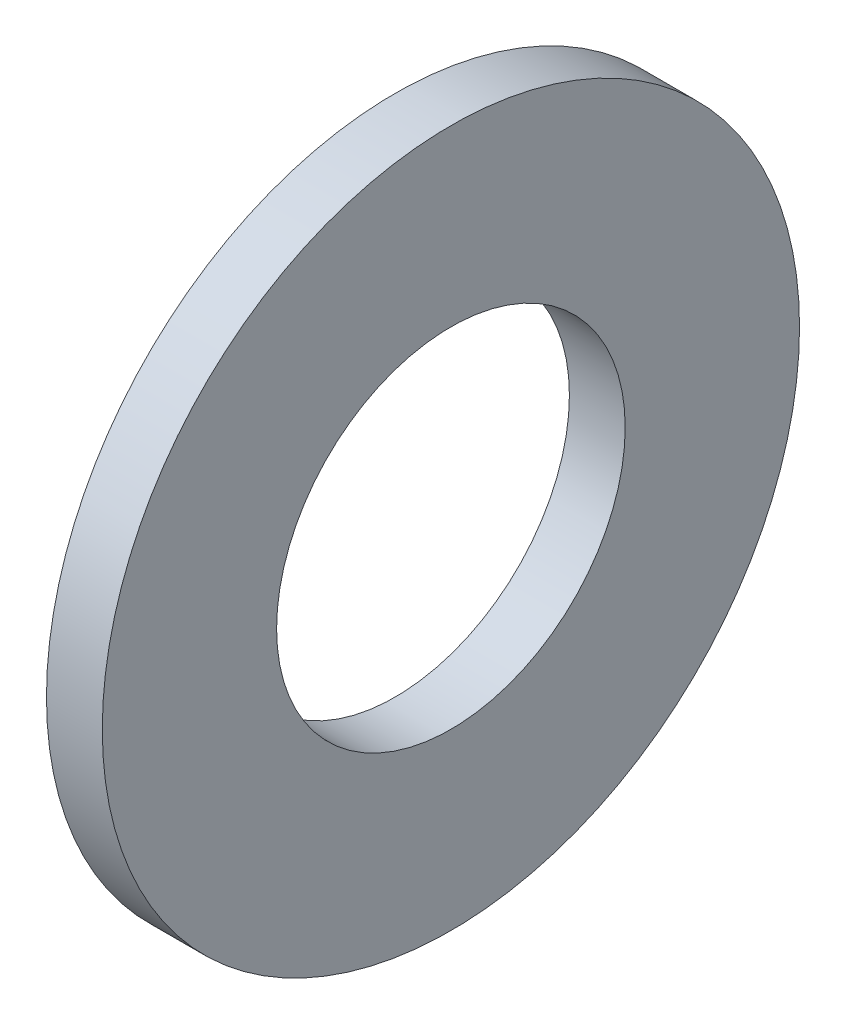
ISO-10303-21;
HEADER;
FILE_DESCRIPTION(('STEP AP214'),'2;1');
FILE_NAME('part.step','',(''),(''),'','','');
FILE_SCHEMA(('AUTOMOTIVE_DESIGN { 1 0 10303 214 1 1 1 1 }'));
ENDSEC;
DATA;
#1=APPLICATION_CONTEXT('core data for automotive mechanical design processes');
#2=APPLICATION_PROTOCOL_DEFINITION('international standard','automotive_design',2000,#1);
#3=PRODUCT_CONTEXT('',#1,'mechanical');
#4=PRODUCT('Part','Part','',(#3));
#5=PRODUCT_RELATED_PRODUCT_CATEGORY('part','',(#4));
#6=PRODUCT_DEFINITION_FORMATION('','',#4);
#7=PRODUCT_DEFINITION_CONTEXT('part definition',#1,'design');
#8=PRODUCT_DEFINITION('design','',#6,#7);
#9=PRODUCT_DEFINITION_SHAPE('','',#8);
#10=(LENGTH_UNIT() NAMED_UNIT(*) SI_UNIT(.MILLI.,.METRE.));
#11=(NAMED_UNIT(*) PLANE_ANGLE_UNIT() SI_UNIT($,.RADIAN.));
#12=(NAMED_UNIT(*) SI_UNIT($,.STERADIAN.) SOLID_ANGLE_UNIT());
#13=UNCERTAINTY_MEASURE_WITH_UNIT(LENGTH_MEASURE(1.E-05),#10,'distance_accuracy_value','');
#14=(GEOMETRIC_REPRESENTATION_CONTEXT(3) GLOBAL_UNCERTAINTY_ASSIGNED_CONTEXT((#13)) GLOBAL_UNIT_ASSIGNED_CONTEXT((#10,
#11,#12)) REPRESENTATION_CONTEXT('',''));
#15=CARTESIAN_POINT('',(0.,0.,0.));
#16=DIRECTION('',(0.,0.,1.));
#17=DIRECTION('',(1.,0.,0.));
#18=AXIS2_PLACEMENT_3D('',#15,#16,#17);
#19=CARTESIAN_POINT('',(-34.9249999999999,0.,0.));
#20=DIRECTION('',(-1.,0.,0.));
#21=DIRECTION('',(0.,0.,1.));
#22=AXIS2_PLACEMENT_3D('',#19,#20,#21);
#23=CYLINDRICAL_SURFACE('',#22,5.1562);
#24=CARTESIAN_POINT('',(0.,0.,0.));
#25=DIRECTION('',(-1.,0.,0.));
#26=DIRECTION('',(0.,0.,1.));
#27=AXIS2_PLACEMENT_3D('',#24,#25,#26);
#28=CIRCLE('',#27,5.1562);
#29=CARTESIAN_POINT('',(0.,0.,5.1562));
#30=VERTEX_POINT('',#29);
#31=EDGE_CURVE('E10',#30,#30,#28,.T.);
#32=ORIENTED_EDGE('',*,*,#31,.F.);
#33=EDGE_LOOP('',(#32));
#34=FACE_BOUND('',#33,.T.);
#35=CARTESIAN_POINT('',(-1.651,0.,0.));
#36=DIRECTION('',(-1.,0.,0.));
#37=DIRECTION('',(0.,0.,1.));
#38=AXIS2_PLACEMENT_3D('',#35,#36,#37);
#39=CIRCLE('',#38,5.1562);
#40=CARTESIAN_POINT('',(-1.651,0.,5.1562));
#41=VERTEX_POINT('',#40);
#42=EDGE_CURVE('E44',#41,#41,#39,.T.);
#43=ORIENTED_EDGE('',*,*,#42,.T.);
#44=EDGE_LOOP('',(#43));
#45=FACE_BOUND('',#44,.T.);
#46=ADVANCED_FACE('F30',(#34,#45),#23,.F.);
#47=CARTESIAN_POINT('',(0.,5.1562,0.));
#48=DIRECTION('',(-1.,0.,0.));
#49=DIRECTION('',(0.,0.,1.));
#50=AXIS2_PLACEMENT_3D('',#47,#48,#49);
#51=PLANE('',#50);
#52=CARTESIAN_POINT('',(0.,0.,0.));
#53=DIRECTION('',(-1.,0.,0.));
#54=DIRECTION('',(0.,0.,1.));
#55=AXIS2_PLACEMENT_3D('',#52,#53,#54);
#56=CIRCLE('',#55,10.3124);
#57=CARTESIAN_POINT('',(0.,0.,10.3124));
#58=VERTEX_POINT('',#57);
#59=EDGE_CURVE('E36',#58,#58,#56,.T.);
#60=ORIENTED_EDGE('',*,*,#59,.F.);
#61=EDGE_LOOP('',(#60));
#62=FACE_BOUND('',#61,.T.);
#63=ORIENTED_EDGE('',*,*,#31,.T.);
#64=EDGE_LOOP('',(#63));
#65=FACE_BOUND('',#64,.T.);
#66=ADVANCED_FACE('F59',(#62,#65),#51,.F.);
#67=CARTESIAN_POINT('',(-34.9249999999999,0.,0.));
#68=DIRECTION('',(-1.,0.,0.));
#69=DIRECTION('',(0.,0.,1.));
#70=AXIS2_PLACEMENT_3D('',#67,#68,#69);
#71=CYLINDRICAL_SURFACE('',#70,10.3124);
#72=CARTESIAN_POINT('',(-1.651,0.,0.));
#73=DIRECTION('',(-1.,0.,0.));
#74=DIRECTION('',(0.,0.,1.));
#75=AXIS2_PLACEMENT_3D('',#72,#73,#74);
#76=CIRCLE('',#75,10.3124);
#77=CARTESIAN_POINT('',(-1.651,0.,10.3124));
#78=VERTEX_POINT('',#77);
#79=EDGE_CURVE('E40',#78,#78,#76,.T.);
#80=ORIENTED_EDGE('',*,*,#79,.F.);
#81=EDGE_LOOP('',(#80));
#82=FACE_BOUND('',#81,.T.);
#83=ORIENTED_EDGE('',*,*,#59,.T.);
#84=EDGE_LOOP('',(#83));
#85=FACE_BOUND('',#84,.T.);
#86=ADVANCED_FACE('F54',(#82,#85),#71,.T.);
#87=CARTESIAN_POINT('',(-1.651,10.3124,0.));
#88=DIRECTION('',(1.,0.,0.));
#89=DIRECTION('',(0.,0.,-1.));
#90=AXIS2_PLACEMENT_3D('',#87,#88,#89);
#91=PLANE('',#90);
#92=ORIENTED_EDGE('',*,*,#42,.F.);
#93=EDGE_LOOP('',(#92));
#94=FACE_BOUND('',#93,.T.);
#95=ORIENTED_EDGE('',*,*,#79,.T.);
#96=EDGE_LOOP('',(#95));
#97=FACE_BOUND('',#96,.T.);
#98=ADVANCED_FACE('F51',(#94,#97),#91,.F.);
#99=CLOSED_SHELL('',(#46,#66,#86,#98));
#100=MANIFOLD_SOLID_BREP('B2',#99);
#101=ADVANCED_BREP_SHAPE_REPRESENTATION('',(#18,#100),#14);
#102=SHAPE_DEFINITION_REPRESENTATION(#9,#101);
ENDSEC;
END-ISO-10303-21;
